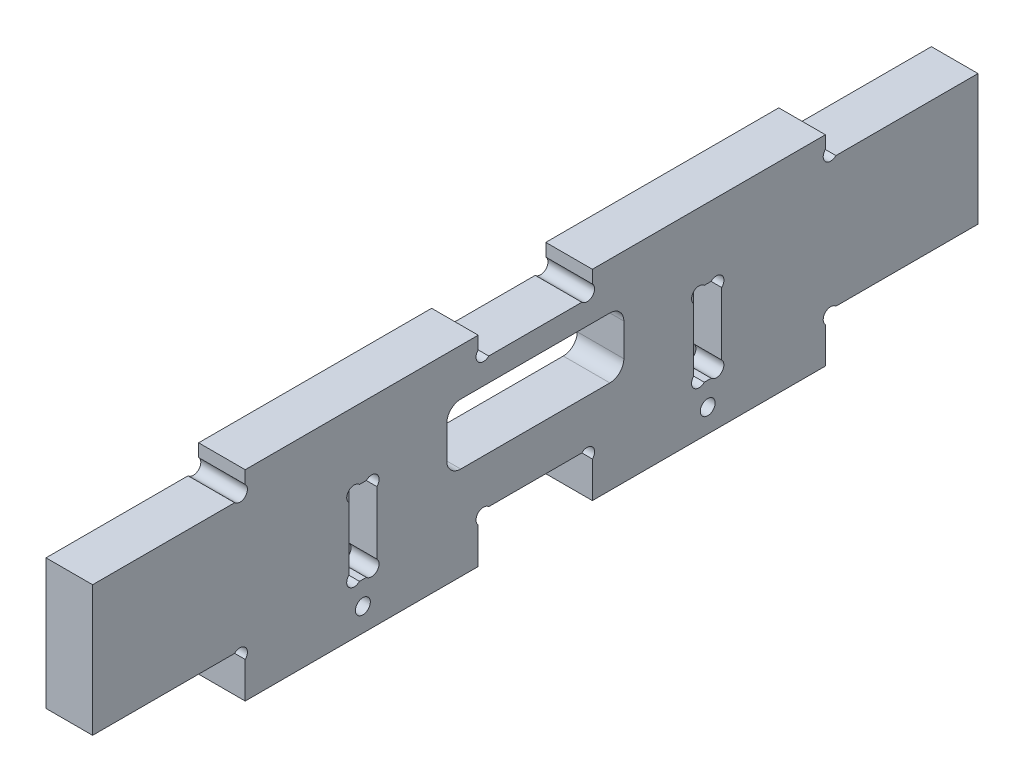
from build123d import *

# Parameters (mm, degrees)
ESQUISSE1_R             = 1.6
EXTRUSION1_DEPTH        = 10
ENL_V_MAT_EXTRU_1_DEPTH = 6


with BuildPart() as part:
    # Esquisse1 → Extrusion1 (new body)
    with BuildSketch(Plane(origin=(0, 0, 0), x_dir=(0, 0, -1), z_dir=(1, 0, 0))):
        with BuildLine():
            Line((82.75, 7.7372583), (82.75, 0))
            Line((82.75, 0), (32.75, 0))
            Line((32.75, 0), (32.75, 7.7372583))
            ThreePointArc((32.75, 7.7372583), (32.75, 10), (30.4872583, 10))
            Line((30.4872583, 10), (0, 10))
            Line((0, 10), (0, 38))
            Line((0, 38), (30.4872583, 38))
            ThreePointArc((30.4872583, 38), (32.75, 38), (32.75, 40.2627417))
            Line((32.75, 40.2627417), (32.75, 43))
            Line((32.75, 43), (82.75, 43))
            Line((82.75, 43), (82.75, 40.2627417))
            ThreePointArc((82.75, 40.2627417), (82.75, 38), (85.0127417, 38))
            Line((85.0127417, 38), (104.9872583, 38))
            ThreePointArc((104.9872583, 38), (107.25, 38), (107.25, 40.2627417))
            Line((107.25, 40.2627417), (107.25, 43))
            Line((107.25, 43), (157.25, 43))
            Line((157.25, 43), (157.25, 40.2627417))
            ThreePointArc((157.25, 40.2627417), (157.25, 38), (159.5127417, 38))
            Line((159.5127417, 38), (190, 38))
            Line((190, 38), (190, 10))
            Line((190, 10), (159.5127417, 10))
            ThreePointArc((159.5127417, 10), (157.25, 10), (157.25, 7.7372583))
            Line((157.25, 7.7372583), (157.25, 0))
            Line((157.25, 0), (107.25, 0))
            Line((107.25, 0), (107.25, 7.7372583))
            ThreePointArc((107.25, 7.7372583), (107.25, 10), (104.9872583, 10))
            Line((104.9872583, 10), (85.0127417, 10))
            ThreePointArc((85.0127417, 10), (82.75, 10), (82.75, 7.7372583))
        make_face()
        with Locations((58, 5)):
            Circle(ESQUISSE1_R, mode=Mode.SUBTRACT)
        with Locations(Location((132, 5, 0), (0, 0, 180))):
            Circle(ESQUISSE1_R, mode=Mode.SUBTRACT)
        with BuildLine():
            Line((114, 30), (114, 23))
            ThreePointArc((114, 23), (113.121320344, 20.878679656), (111, 20))
            Line((111, 20), (79, 20))
            ThreePointArc((79, 20), (76.878679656, 20.878679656), (76, 23))
            Line((76, 23), (76, 30))
            ThreePointArc((76, 30), (76.878679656, 32.121320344), (79, 33))
            Line((79, 33), (111, 33))
            ThreePointArc((111, 33), (113.121320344, 32.121320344), (114, 30))
        make_face(mode=Mode.SUBTRACT)
    extrude(amount=EXTRUSION1_DEPTH)

    # Esquisse2 → Enl_v. mat.-Extru.1 (cut)
    with BuildSketch(Plane(origin=(10, 0, 0), x_dir=(0, 0, -1), z_dir=(1, 0, 0))):
        with BuildLine():
            Line((131.2627417, 28), (132.7372583, 28))
            ThreePointArc((132.7372583, 28), (135, 28), (135, 25.7372583))
            Line((135, 25.7372583), (135, 12.2627417))
            ThreePointArc((135, 12.2627417), (135, 10), (132.7372583, 10))
            Line((132.7372583, 10), (131.2627417, 10))
            ThreePointArc((131.2627417, 10), (129, 10), (129, 12.2627417))
            Line((129, 12.2627417), (129, 25.7372583))
            ThreePointArc((129, 25.7372583), (129, 28), (131.2627417, 28))
        make_face()
        with BuildLine():
            Line((58.7372583, 28), (57.2627417, 28))
            ThreePointArc((57.2627417, 28), (55, 28), (55, 25.7372583))
            Line((55, 25.7372583), (55, 12.2627417))
            ThreePointArc((55, 12.2627417), (55, 10), (57.2627417, 10))
            Line((57.2627417, 10), (58.7372583, 10))
            ThreePointArc((58.7372583, 10), (61, 10), (61, 12.2627417))
            Line((61, 12.2627417), (61, 25.7372583))
            ThreePointArc((61, 25.7372583), (61, 28), (58.7372583, 28))
        make_face()
    extrude(amount=-ENL_V_MAT_EXTRU_1_DEPTH, mode=Mode.SUBTRACT)


solid = part.part
